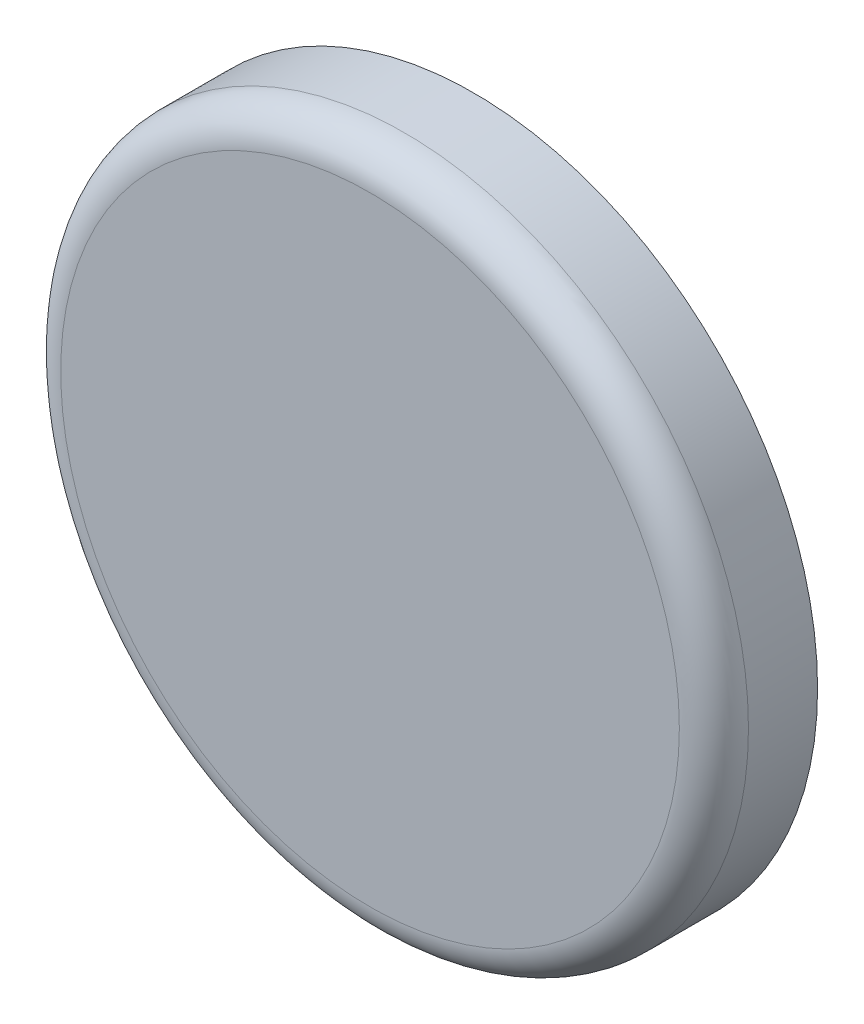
from build123d import *

# Parameters (mm, degrees)
SKETCH1_R           = 9.95
BOSS_EXTRUDE1_DEPTH = 3
FILLET1_R           = 1


with BuildPart() as part:
    # Sketch1 → Boss-Extrude1 (new body)
    with BuildSketch(Plane.XY):
        Circle(SKETCH1_R)
    extrude(amount=BOSS_EXTRUDE1_DEPTH)

    # Fillet1
    fillet1_edges = [part.edges().sort_by_distance(p)[0] for p in [
        (-9.95, 0, 3),
    ]]
    fillet(fillet1_edges, radius=FILLET1_R)


solid = part.part
